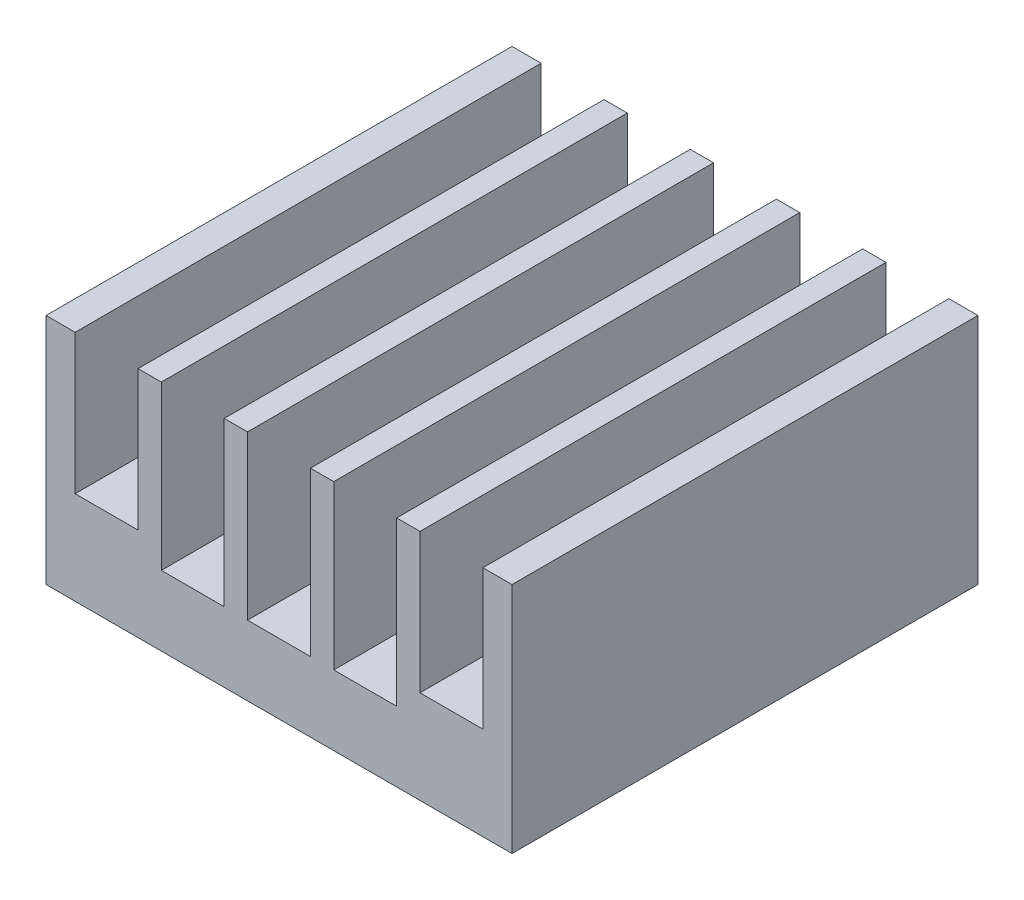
ISO-10303-21;
HEADER;
FILE_DESCRIPTION(('STEP AP214'),'2;1');
FILE_NAME('part.step','',(''),(''),'','','');
FILE_SCHEMA(('AUTOMOTIVE_DESIGN { 1 0 10303 214 1 1 1 1 }'));
ENDSEC;
DATA;
#1=APPLICATION_CONTEXT('core data for automotive mechanical design processes');
#2=APPLICATION_PROTOCOL_DEFINITION('international standard','automotive_design',2000,#1);
#3=PRODUCT_CONTEXT('',#1,'mechanical');
#4=PRODUCT('Part','Part','',(#3));
#5=PRODUCT_RELATED_PRODUCT_CATEGORY('part','',(#4));
#6=PRODUCT_DEFINITION_FORMATION('','',#4);
#7=PRODUCT_DEFINITION_CONTEXT('part definition',#1,'design');
#8=PRODUCT_DEFINITION('design','',#6,#7);
#9=PRODUCT_DEFINITION_SHAPE('','',#8);
#10=(LENGTH_UNIT() NAMED_UNIT(*) SI_UNIT(.MILLI.,.METRE.));
#11=(NAMED_UNIT(*) PLANE_ANGLE_UNIT() SI_UNIT($,.RADIAN.));
#12=(NAMED_UNIT(*) SI_UNIT($,.STERADIAN.) SOLID_ANGLE_UNIT());
#13=UNCERTAINTY_MEASURE_WITH_UNIT(LENGTH_MEASURE(1.E-05),#10,'distance_accuracy_value','');
#14=(GEOMETRIC_REPRESENTATION_CONTEXT(3) GLOBAL_UNCERTAINTY_ASSIGNED_CONTEXT((#13)) GLOBAL_UNIT_ASSIGNED_CONTEXT((#10,
#11,#12)) REPRESENTATION_CONTEXT('',''));
#15=CARTESIAN_POINT('',(0.,0.,0.));
#16=DIRECTION('',(0.,0.,1.));
#17=DIRECTION('',(1.,0.,0.));
#18=AXIS2_PLACEMENT_3D('',#15,#16,#17);
#19=CARTESIAN_POINT('',(-20.,20.,40.));
#20=DIRECTION('',(1.,0.,0.));
#21=DIRECTION('',(0.,0.,-1.));
#22=AXIS2_PLACEMENT_3D('',#19,#20,#21);
#23=PLANE('',#22);
#24=DIRECTION('',(0.,-1.,0.));
#25=VECTOR('',#24,1.);
#26=CARTESIAN_POINT('',(-20.,20.,0.));
#27=LINE('',#26,#25);
#28=CARTESIAN_POINT('',(-20.,20.,0.));
#29=VERTEX_POINT('',#28);
#30=CARTESIAN_POINT('',(-20.,0.,0.));
#31=VERTEX_POINT('',#30);
#32=EDGE_CURVE('E226',#29,#31,#27,.T.);
#33=ORIENTED_EDGE('',*,*,#32,.T.);
#34=DIRECTION('',(0.,0.,-1.));
#35=VECTOR('',#34,1.);
#36=CARTESIAN_POINT('',(-20.,0.,40.));
#37=LINE('',#36,#35);
#38=CARTESIAN_POINT('',(-20.,0.,40.));
#39=VERTEX_POINT('',#38);
#40=EDGE_CURVE('E11',#39,#31,#37,.T.);
#41=ORIENTED_EDGE('',*,*,#40,.F.);
#42=DIRECTION('',(0.,-1.,0.));
#43=VECTOR('',#42,1.);
#44=CARTESIAN_POINT('',(-20.,20.,40.));
#45=LINE('',#44,#43);
#46=CARTESIAN_POINT('',(-20.,20.,40.));
#47=VERTEX_POINT('',#46);
#48=EDGE_CURVE('E272',#47,#39,#45,.T.);
#49=ORIENTED_EDGE('',*,*,#48,.F.);
#50=DIRECTION('',(0.,0.,-1.));
#51=VECTOR('',#50,1.);
#52=CARTESIAN_POINT('',(-20.,20.,40.));
#53=LINE('',#52,#51);
#54=EDGE_CURVE('E222',#47,#29,#53,.T.);
#55=ORIENTED_EDGE('',*,*,#54,.T.);
#56=EDGE_LOOP('',(#33,#41,#49,#55));
#57=FACE_BOUND('',#56,.T.);
#58=ADVANCED_FACE('F34',(#57),#23,.F.);
#59=CARTESIAN_POINT('',(-20.,0.,40.));
#60=DIRECTION('',(0.,1.,0.));
#61=DIRECTION('',(0.,0.,1.));
#62=AXIS2_PLACEMENT_3D('',#59,#60,#61);
#63=PLANE('',#62);
#64=DIRECTION('',(1.,0.,0.));
#65=VECTOR('',#64,1.);
#66=CARTESIAN_POINT('',(-20.,0.,0.));
#67=LINE('',#66,#65);
#68=CARTESIAN_POINT('',(20.,0.,0.));
#69=VERTEX_POINT('',#68);
#70=EDGE_CURVE('E229',#31,#69,#67,.T.);
#71=ORIENTED_EDGE('',*,*,#70,.T.);
#72=DIRECTION('',(0.,0.,-1.));
#73=VECTOR('',#72,1.);
#74=CARTESIAN_POINT('',(20.,0.,40.));
#75=LINE('',#74,#73);
#76=CARTESIAN_POINT('',(20.,0.,40.));
#77=VERTEX_POINT('',#76);
#78=EDGE_CURVE('E42',#77,#69,#75,.T.);
#79=ORIENTED_EDGE('',*,*,#78,.F.);
#80=DIRECTION('',(1.,0.,0.));
#81=VECTOR('',#80,1.);
#82=CARTESIAN_POINT('',(-20.,0.,40.));
#83=LINE('',#82,#81);
#84=EDGE_CURVE('E141',#39,#77,#83,.T.);
#85=ORIENTED_EDGE('',*,*,#84,.F.);
#86=ORIENTED_EDGE('',*,*,#40,.T.);
#87=EDGE_LOOP('',(#71,#79,#85,#86));
#88=FACE_BOUND('',#87,.T.);
#89=ADVANCED_FACE('F410',(#88),#63,.F.);
#90=CARTESIAN_POINT('',(20.,0.,40.));
#91=DIRECTION('',(-1.,0.,0.));
#92=DIRECTION('',(0.,-1.,0.));
#93=AXIS2_PLACEMENT_3D('',#90,#91,#92);
#94=PLANE('',#93);
#95=DIRECTION('',(0.,1.,0.));
#96=VECTOR('',#95,1.);
#97=CARTESIAN_POINT('',(20.,0.,0.));
#98=LINE('',#97,#96);
#99=CARTESIAN_POINT('',(20.,20.,0.));
#100=VERTEX_POINT('',#99);
#101=EDGE_CURVE('E231',#69,#100,#98,.T.);
#102=ORIENTED_EDGE('',*,*,#101,.T.);
#103=DIRECTION('',(0.,0.,-1.));
#104=VECTOR('',#103,1.);
#105=CARTESIAN_POINT('',(20.,20.,40.));
#106=LINE('',#105,#104);
#107=CARTESIAN_POINT('',(20.,20.,40.));
#108=VERTEX_POINT('',#107);
#109=EDGE_CURVE('E327',#108,#100,#106,.T.);
#110=ORIENTED_EDGE('',*,*,#109,.F.);
#111=DIRECTION('',(0.,1.,0.));
#112=VECTOR('',#111,1.);
#113=CARTESIAN_POINT('',(20.,0.,40.));
#114=LINE('',#113,#112);
#115=EDGE_CURVE('E335',#77,#108,#114,.T.);
#116=ORIENTED_EDGE('',*,*,#115,.F.);
#117=ORIENTED_EDGE('',*,*,#78,.T.);
#118=EDGE_LOOP('',(#102,#110,#116,#117));
#119=FACE_BOUND('',#118,.T.);
#120=ADVANCED_FACE('F333',(#119),#94,.F.);
#121=CARTESIAN_POINT('',(20.,20.,40.));
#122=DIRECTION('',(0.,-1.,0.));
#123=DIRECTION('',(0.,0.,-1.));
#124=AXIS2_PLACEMENT_3D('',#121,#122,#123);
#125=PLANE('',#124);
#126=DIRECTION('',(-1.,0.,0.));
#127=VECTOR('',#126,1.);
#128=CARTESIAN_POINT('',(20.,20.,0.));
#129=LINE('',#128,#127);
#130=CARTESIAN_POINT('',(17.5,20.,0.));
#131=VERTEX_POINT('',#130);
#132=EDGE_CURVE('E233',#100,#131,#129,.T.);
#133=ORIENTED_EDGE('',*,*,#132,.T.);
#134=DIRECTION('',(0.,0.,-1.));
#135=VECTOR('',#134,1.);
#136=CARTESIAN_POINT('',(17.5,20.,40.));
#137=LINE('',#136,#135);
#138=CARTESIAN_POINT('',(17.5,20.,40.));
#139=VERTEX_POINT('',#138);
#140=EDGE_CURVE('E324',#139,#131,#137,.T.);
#141=ORIENTED_EDGE('',*,*,#140,.F.);
#142=DIRECTION('',(-1.,0.,0.));
#143=VECTOR('',#142,1.);
#144=CARTESIAN_POINT('',(20.,20.,40.));
#145=LINE('',#144,#143);
#146=EDGE_CURVE('E353',#108,#139,#145,.T.);
#147=ORIENTED_EDGE('',*,*,#146,.F.);
#148=ORIENTED_EDGE('',*,*,#109,.T.);
#149=EDGE_LOOP('',(#133,#141,#147,#148));
#150=FACE_BOUND('',#149,.T.);
#151=ADVANCED_FACE('F344',(#150),#125,.F.);
#152=CARTESIAN_POINT('',(17.5,20.,40.));
#153=DIRECTION('',(1.,0.,0.));
#154=DIRECTION('',(0.,0.,-1.));
#155=AXIS2_PLACEMENT_3D('',#152,#153,#154);
#156=PLANE('',#155);
#157=DIRECTION('',(0.,-1.,0.));
#158=VECTOR('',#157,1.);
#159=CARTESIAN_POINT('',(17.5,20.,0.));
#160=LINE('',#159,#158);
#161=CARTESIAN_POINT('',(17.5,8.,0.));
#162=VERTEX_POINT('',#161);
#163=EDGE_CURVE('E235',#131,#162,#160,.T.);
#164=ORIENTED_EDGE('',*,*,#163,.T.);
#165=DIRECTION('',(0.,0.,-1.));
#166=VECTOR('',#165,1.);
#167=CARTESIAN_POINT('',(17.5,8.,40.));
#168=LINE('',#167,#166);
#169=CARTESIAN_POINT('',(17.5,8.,40.));
#170=VERTEX_POINT('',#169);
#171=EDGE_CURVE('E321',#170,#162,#168,.T.);
#172=ORIENTED_EDGE('',*,*,#171,.F.);
#173=DIRECTION('',(0.,-1.,0.));
#174=VECTOR('',#173,1.);
#175=CARTESIAN_POINT('',(17.5,20.,40.));
#176=LINE('',#175,#174);
#177=EDGE_CURVE('E350',#139,#170,#176,.T.);
#178=ORIENTED_EDGE('',*,*,#177,.F.);
#179=ORIENTED_EDGE('',*,*,#140,.T.);
#180=EDGE_LOOP('',(#164,#172,#178,#179));
#181=FACE_BOUND('',#180,.T.);
#182=ADVANCED_FACE('F348',(#181),#156,.F.);
#183=CARTESIAN_POINT('',(17.5,8.,40.));
#184=DIRECTION('',(0.,-1.,0.));
#185=DIRECTION('',(0.,0.,-1.));
#186=AXIS2_PLACEMENT_3D('',#183,#184,#185);
#187=PLANE('',#186);
#188=DIRECTION('',(-1.,0.,0.));
#189=VECTOR('',#188,1.);
#190=CARTESIAN_POINT('',(17.5,8.,0.));
#191=LINE('',#190,#189);
#192=CARTESIAN_POINT('',(12.1,8.,0.));
#193=VERTEX_POINT('',#192);
#194=EDGE_CURVE('E237',#162,#193,#191,.T.);
#195=ORIENTED_EDGE('',*,*,#194,.T.);
#196=DIRECTION('',(0.,0.,-1.));
#197=VECTOR('',#196,1.);
#198=CARTESIAN_POINT('',(12.1,8.,40.));
#199=LINE('',#198,#197);
#200=CARTESIAN_POINT('',(12.1,8.,40.));
#201=VERTEX_POINT('',#200);
#202=EDGE_CURVE('E318',#201,#193,#199,.T.);
#203=ORIENTED_EDGE('',*,*,#202,.F.);
#204=DIRECTION('',(-1.,0.,0.));
#205=VECTOR('',#204,1.);
#206=CARTESIAN_POINT('',(17.5,8.,40.));
#207=LINE('',#206,#205);
#208=EDGE_CURVE('E352',#170,#201,#207,.T.);
#209=ORIENTED_EDGE('',*,*,#208,.F.);
#210=ORIENTED_EDGE('',*,*,#171,.T.);
#211=EDGE_LOOP('',(#195,#203,#209,#210));
#212=FACE_BOUND('',#211,.T.);
#213=ADVANCED_FACE('F423',(#212),#187,.F.);
#214=CARTESIAN_POINT('',(12.1,8.,40.));
#215=DIRECTION('',(-1.,0.,0.));
#216=DIRECTION('',(0.,0.,1.));
#217=AXIS2_PLACEMENT_3D('',#214,#215,#216);
#218=PLANE('',#217);
#219=DIRECTION('',(0.,1.,0.));
#220=VECTOR('',#219,1.);
#221=CARTESIAN_POINT('',(12.1,8.,0.));
#222=LINE('',#221,#220);
#223=CARTESIAN_POINT('',(12.1,20.,0.));
#224=VERTEX_POINT('',#223);
#225=EDGE_CURVE('E239',#193,#224,#222,.T.);
#226=ORIENTED_EDGE('',*,*,#225,.T.);
#227=DIRECTION('',(0.,0.,-1.));
#228=VECTOR('',#227,1.);
#229=CARTESIAN_POINT('',(12.1,20.,40.));
#230=LINE('',#229,#228);
#231=CARTESIAN_POINT('',(12.1,20.,40.));
#232=VERTEX_POINT('',#231);
#233=EDGE_CURVE('E315',#232,#224,#230,.T.);
#234=ORIENTED_EDGE('',*,*,#233,.F.);
#235=DIRECTION('',(0.,1.,0.));
#236=VECTOR('',#235,1.);
#237=CARTESIAN_POINT('',(12.1,8.,40.));
#238=LINE('',#237,#236);
#239=EDGE_CURVE('E355',#201,#232,#238,.T.);
#240=ORIENTED_EDGE('',*,*,#239,.F.);
#241=ORIENTED_EDGE('',*,*,#202,.T.);
#242=EDGE_LOOP('',(#226,#234,#240,#241));
#243=FACE_BOUND('',#242,.T.);
#244=ADVANCED_FACE('F426',(#243),#218,.F.);
#245=CARTESIAN_POINT('',(12.1,20.,40.));
#246=DIRECTION('',(0.,-1.,0.));
#247=DIRECTION('',(1.,0.,0.));
#248=AXIS2_PLACEMENT_3D('',#245,#246,#247);
#249=PLANE('',#248);
#250=DIRECTION('',(-1.,0.,0.));
#251=VECTOR('',#250,1.);
#252=CARTESIAN_POINT('',(12.1,20.,0.));
#253=LINE('',#252,#251);
#254=CARTESIAN_POINT('',(10.1,20.,0.));
#255=VERTEX_POINT('',#254);
#256=EDGE_CURVE('E241',#224,#255,#253,.T.);
#257=ORIENTED_EDGE('',*,*,#256,.T.);
#258=DIRECTION('',(0.,0.,-1.));
#259=VECTOR('',#258,1.);
#260=CARTESIAN_POINT('',(10.1,20.,40.));
#261=LINE('',#260,#259);
#262=CARTESIAN_POINT('',(10.1,20.,40.));
#263=VERTEX_POINT('',#262);
#264=EDGE_CURVE('E312',#263,#255,#261,.T.);
#265=ORIENTED_EDGE('',*,*,#264,.F.);
#266=DIRECTION('',(-1.,0.,0.));
#267=VECTOR('',#266,1.);
#268=CARTESIAN_POINT('',(12.1,20.,40.));
#269=LINE('',#268,#267);
#270=EDGE_CURVE('E361',#232,#263,#269,.T.);
#271=ORIENTED_EDGE('',*,*,#270,.F.);
#272=ORIENTED_EDGE('',*,*,#233,.T.);
#273=EDGE_LOOP('',(#257,#265,#271,#272));
#274=FACE_BOUND('',#273,.T.);
#275=ADVANCED_FACE('F430',(#274),#249,.F.);
#276=CARTESIAN_POINT('',(10.1,20.,40.));
#277=DIRECTION('',(1.,0.,0.));
#278=DIRECTION('',(0.,1.,0.));
#279=AXIS2_PLACEMENT_3D('',#276,#277,#278);
#280=PLANE('',#279);
#281=DIRECTION('',(0.,-1.,0.));
#282=VECTOR('',#281,1.);
#283=CARTESIAN_POINT('',(10.1,20.,0.));
#284=LINE('',#283,#282);
#285=CARTESIAN_POINT('',(10.1,6.,0.));
#286=VERTEX_POINT('',#285);
#287=EDGE_CURVE('E243',#255,#286,#284,.T.);
#288=ORIENTED_EDGE('',*,*,#287,.T.);
#289=DIRECTION('',(0.,0.,-1.));
#290=VECTOR('',#289,1.);
#291=CARTESIAN_POINT('',(10.1,6.,40.));
#292=LINE('',#291,#290);
#293=CARTESIAN_POINT('',(10.1,6.,40.));
#294=VERTEX_POINT('',#293);
#295=EDGE_CURVE('E309',#294,#286,#292,.T.);
#296=ORIENTED_EDGE('',*,*,#295,.F.);
#297=DIRECTION('',(0.,-1.,0.));
#298=VECTOR('',#297,1.);
#299=CARTESIAN_POINT('',(10.1,20.,40.));
#300=LINE('',#299,#298);
#301=EDGE_CURVE('E363',#263,#294,#300,.T.);
#302=ORIENTED_EDGE('',*,*,#301,.F.);
#303=ORIENTED_EDGE('',*,*,#264,.T.);
#304=EDGE_LOOP('',(#288,#296,#302,#303));
#305=FACE_BOUND('',#304,.T.);
#306=ADVANCED_FACE('F434',(#305),#280,.F.);
#307=CARTESIAN_POINT('',(10.1,6.,40.));
#308=DIRECTION('',(0.,-1.,0.));
#309=DIRECTION('',(0.,0.,-1.));
#310=AXIS2_PLACEMENT_3D('',#307,#308,#309);
#311=PLANE('',#310);
#312=DIRECTION('',(-1.,0.,0.));
#313=VECTOR('',#312,1.);
#314=CARTESIAN_POINT('',(10.1,6.,0.));
#315=LINE('',#314,#313);
#316=CARTESIAN_POINT('',(4.7,6.,0.));
#317=VERTEX_POINT('',#316);
#318=EDGE_CURVE('E245',#286,#317,#315,.T.);
#319=ORIENTED_EDGE('',*,*,#318,.T.);
#320=DIRECTION('',(0.,0.,-1.));
#321=VECTOR('',#320,1.);
#322=CARTESIAN_POINT('',(4.7,6.,40.));
#323=LINE('',#322,#321);
#324=CARTESIAN_POINT('',(4.7,6.,40.));
#325=VERTEX_POINT('',#324);
#326=EDGE_CURVE('E306',#325,#317,#323,.T.);
#327=ORIENTED_EDGE('',*,*,#326,.F.);
#328=DIRECTION('',(-1.,0.,0.));
#329=VECTOR('',#328,1.);
#330=CARTESIAN_POINT('',(10.1,6.,40.));
#331=LINE('',#330,#329);
#332=EDGE_CURVE('E365',#294,#325,#331,.T.);
#333=ORIENTED_EDGE('',*,*,#332,.F.);
#334=ORIENTED_EDGE('',*,*,#295,.T.);
#335=EDGE_LOOP('',(#319,#327,#333,#334));
#336=FACE_BOUND('',#335,.T.);
#337=ADVANCED_FACE('F438',(#336),#311,.F.);
#338=CARTESIAN_POINT('',(4.7,6.,40.));
#339=DIRECTION('',(-1.,0.,0.));
#340=DIRECTION('',(0.,0.,1.));
#341=AXIS2_PLACEMENT_3D('',#338,#339,#340);
#342=PLANE('',#341);
#343=DIRECTION('',(0.,1.,0.));
#344=VECTOR('',#343,1.);
#345=CARTESIAN_POINT('',(4.7,6.,0.));
#346=LINE('',#345,#344);
#347=CARTESIAN_POINT('',(4.7,20.,0.));
#348=VERTEX_POINT('',#347);
#349=EDGE_CURVE('E247',#317,#348,#346,.T.);
#350=ORIENTED_EDGE('',*,*,#349,.T.);
#351=DIRECTION('',(0.,0.,-1.));
#352=VECTOR('',#351,1.);
#353=CARTESIAN_POINT('',(4.7,20.,40.));
#354=LINE('',#353,#352);
#355=CARTESIAN_POINT('',(4.7,20.,40.));
#356=VERTEX_POINT('',#355);
#357=EDGE_CURVE('E303',#356,#348,#354,.T.);
#358=ORIENTED_EDGE('',*,*,#357,.F.);
#359=DIRECTION('',(0.,1.,0.));
#360=VECTOR('',#359,1.);
#361=CARTESIAN_POINT('',(4.7,6.,40.));
#362=LINE('',#361,#360);
#363=EDGE_CURVE('E367',#325,#356,#362,.T.);
#364=ORIENTED_EDGE('',*,*,#363,.F.);
#365=ORIENTED_EDGE('',*,*,#326,.T.);
#366=EDGE_LOOP('',(#350,#358,#364,#365));
#367=FACE_BOUND('',#366,.T.);
#368=ADVANCED_FACE('F442',(#367),#342,.F.);
#369=CARTESIAN_POINT('',(4.7,20.,40.));
#370=DIRECTION('',(0.,-1.,0.));
#371=DIRECTION('',(0.,0.,-1.));
#372=AXIS2_PLACEMENT_3D('',#369,#370,#371);
#373=PLANE('',#372);
#374=DIRECTION('',(-1.,0.,0.));
#375=VECTOR('',#374,1.);
#376=CARTESIAN_POINT('',(4.7,20.,0.));
#377=LINE('',#376,#375);
#378=CARTESIAN_POINT('',(2.7,20.,0.));
#379=VERTEX_POINT('',#378);
#380=EDGE_CURVE('E249',#348,#379,#377,.T.);
#381=ORIENTED_EDGE('',*,*,#380,.T.);
#382=DIRECTION('',(0.,0.,-1.));
#383=VECTOR('',#382,1.);
#384=CARTESIAN_POINT('',(2.7,20.,40.));
#385=LINE('',#384,#383);
#386=CARTESIAN_POINT('',(2.7,20.,40.));
#387=VERTEX_POINT('',#386);
#388=EDGE_CURVE('E300',#387,#379,#385,.T.);
#389=ORIENTED_EDGE('',*,*,#388,.F.);
#390=DIRECTION('',(-1.,0.,0.));
#391=VECTOR('',#390,1.);
#392=CARTESIAN_POINT('',(4.7,20.,40.));
#393=LINE('',#392,#391);
#394=EDGE_CURVE('E369',#356,#387,#393,.T.);
#395=ORIENTED_EDGE('',*,*,#394,.F.);
#396=ORIENTED_EDGE('',*,*,#357,.T.);
#397=EDGE_LOOP('',(#381,#389,#395,#396));
#398=FACE_BOUND('',#397,.T.);
#399=ADVANCED_FACE('F446',(#398),#373,.F.);
#400=CARTESIAN_POINT('',(2.7,20.,40.));
#401=DIRECTION('',(1.,0.,0.));
#402=DIRECTION('',(0.,0.,-1.));
#403=AXIS2_PLACEMENT_3D('',#400,#401,#402);
#404=PLANE('',#403);
#405=DIRECTION('',(0.,-1.,0.));
#406=VECTOR('',#405,1.);
#407=CARTESIAN_POINT('',(2.7,20.,0.));
#408=LINE('',#407,#406);
#409=CARTESIAN_POINT('',(2.7,6.,0.));
#410=VERTEX_POINT('',#409);
#411=EDGE_CURVE('E251',#379,#410,#408,.T.);
#412=ORIENTED_EDGE('',*,*,#411,.T.);
#413=DIRECTION('',(0.,0.,-1.));
#414=VECTOR('',#413,1.);
#415=CARTESIAN_POINT('',(2.7,6.,40.));
#416=LINE('',#415,#414);
#417=CARTESIAN_POINT('',(2.7,6.,40.));
#418=VERTEX_POINT('',#417);
#419=EDGE_CURVE('E297',#418,#410,#416,.T.);
#420=ORIENTED_EDGE('',*,*,#419,.F.);
#421=DIRECTION('',(0.,-1.,0.));
#422=VECTOR('',#421,1.);
#423=CARTESIAN_POINT('',(2.7,20.,40.));
#424=LINE('',#423,#422);
#425=EDGE_CURVE('E371',#387,#418,#424,.T.);
#426=ORIENTED_EDGE('',*,*,#425,.F.);
#427=ORIENTED_EDGE('',*,*,#388,.T.);
#428=EDGE_LOOP('',(#412,#420,#426,#427));
#429=FACE_BOUND('',#428,.T.);
#430=ADVANCED_FACE('F450',(#429),#404,.F.);
#431=CARTESIAN_POINT('',(2.7,6.,40.));
#432=DIRECTION('',(0.,-1.,0.));
#433=DIRECTION('',(0.,0.,-1.));
#434=AXIS2_PLACEMENT_3D('',#431,#432,#433);
#435=PLANE('',#434);
#436=DIRECTION('',(-1.,0.,0.));
#437=VECTOR('',#436,1.);
#438=CARTESIAN_POINT('',(2.7,6.,0.));
#439=LINE('',#438,#437);
#440=CARTESIAN_POINT('',(-2.69999999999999,6.,0.));
#441=VERTEX_POINT('',#440);
#442=EDGE_CURVE('E253',#410,#441,#439,.T.);
#443=ORIENTED_EDGE('',*,*,#442,.T.);
#444=DIRECTION('',(0.,0.,-1.));
#445=VECTOR('',#444,1.);
#446=CARTESIAN_POINT('',(-2.69999999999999,6.,40.));
#447=LINE('',#446,#445);
#448=CARTESIAN_POINT('',(-2.69999999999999,6.,40.));
#449=VERTEX_POINT('',#448);
#450=EDGE_CURVE('E294',#449,#441,#447,.T.);
#451=ORIENTED_EDGE('',*,*,#450,.F.);
#452=DIRECTION('',(-1.,0.,0.));
#453=VECTOR('',#452,1.);
#454=CARTESIAN_POINT('',(2.7,6.,40.));
#455=LINE('',#454,#453);
#456=EDGE_CURVE('E373',#418,#449,#455,.T.);
#457=ORIENTED_EDGE('',*,*,#456,.F.);
#458=ORIENTED_EDGE('',*,*,#419,.T.);
#459=EDGE_LOOP('',(#443,#451,#457,#458));
#460=FACE_BOUND('',#459,.T.);
#461=ADVANCED_FACE('F454',(#460),#435,.F.);
#462=CARTESIAN_POINT('',(-2.69999999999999,6.,40.));
#463=DIRECTION('',(-1.,0.,0.));
#464=DIRECTION('',(0.,-1.,0.));
#465=AXIS2_PLACEMENT_3D('',#462,#463,#464);
#466=PLANE('',#465);
#467=DIRECTION('',(0.,1.,0.));
#468=VECTOR('',#467,1.);
#469=CARTESIAN_POINT('',(-2.69999999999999,6.,0.));
#470=LINE('',#469,#468);
#471=CARTESIAN_POINT('',(-2.7,20.,0.));
#472=VERTEX_POINT('',#471);
#473=EDGE_CURVE('E255',#441,#472,#470,.T.);
#474=ORIENTED_EDGE('',*,*,#473,.T.);
#475=DIRECTION('',(0.,0.,-1.));
#476=VECTOR('',#475,1.);
#477=CARTESIAN_POINT('',(-2.7,20.,40.));
#478=LINE('',#477,#476);
#479=CARTESIAN_POINT('',(-2.7,20.,40.));
#480=VERTEX_POINT('',#479);
#481=EDGE_CURVE('E291',#480,#472,#478,.T.);
#482=ORIENTED_EDGE('',*,*,#481,.F.);
#483=DIRECTION('',(0.,1.,0.));
#484=VECTOR('',#483,1.);
#485=CARTESIAN_POINT('',(-2.69999999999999,6.,40.));
#486=LINE('',#485,#484);
#487=EDGE_CURVE('E375',#449,#480,#486,.T.);
#488=ORIENTED_EDGE('',*,*,#487,.F.);
#489=ORIENTED_EDGE('',*,*,#450,.T.);
#490=EDGE_LOOP('',(#474,#482,#488,#489));
#491=FACE_BOUND('',#490,.T.);
#492=ADVANCED_FACE('F458',(#491),#466,.F.);
#493=CARTESIAN_POINT('',(-2.7,20.,40.));
#494=DIRECTION('',(0.,-1.,0.));
#495=DIRECTION('',(0.,0.,-1.));
#496=AXIS2_PLACEMENT_3D('',#493,#494,#495);
#497=PLANE('',#496);
#498=DIRECTION('',(-1.,0.,0.));
#499=VECTOR('',#498,1.);
#500=CARTESIAN_POINT('',(-2.7,20.,0.));
#501=LINE('',#500,#499);
#502=CARTESIAN_POINT('',(-4.7,20.,0.));
#503=VERTEX_POINT('',#502);
#504=EDGE_CURVE('E257',#472,#503,#501,.T.);
#505=ORIENTED_EDGE('',*,*,#504,.T.);
#506=DIRECTION('',(0.,0.,-1.));
#507=VECTOR('',#506,1.);
#508=CARTESIAN_POINT('',(-4.7,20.,40.));
#509=LINE('',#508,#507);
#510=CARTESIAN_POINT('',(-4.7,20.,40.));
#511=VERTEX_POINT('',#510);
#512=EDGE_CURVE('E288',#511,#503,#509,.T.);
#513=ORIENTED_EDGE('',*,*,#512,.F.);
#514=DIRECTION('',(-1.,0.,0.));
#515=VECTOR('',#514,1.);
#516=CARTESIAN_POINT('',(-2.7,20.,40.));
#517=LINE('',#516,#515);
#518=EDGE_CURVE('E377',#480,#511,#517,.T.);
#519=ORIENTED_EDGE('',*,*,#518,.F.);
#520=ORIENTED_EDGE('',*,*,#481,.T.);
#521=EDGE_LOOP('',(#505,#513,#519,#520));
#522=FACE_BOUND('',#521,.T.);
#523=ADVANCED_FACE('F462',(#522),#497,.F.);
#524=CARTESIAN_POINT('',(-4.7,20.,40.));
#525=DIRECTION('',(1.,0.,0.));
#526=DIRECTION('',(0.,1.,0.));
#527=AXIS2_PLACEMENT_3D('',#524,#525,#526);
#528=PLANE('',#527);
#529=DIRECTION('',(0.,-1.,0.));
#530=VECTOR('',#529,1.);
#531=CARTESIAN_POINT('',(-4.7,20.,0.));
#532=LINE('',#531,#530);
#533=CARTESIAN_POINT('',(-4.7,6.,0.));
#534=VERTEX_POINT('',#533);
#535=EDGE_CURVE('E259',#503,#534,#532,.T.);
#536=ORIENTED_EDGE('',*,*,#535,.T.);
#537=DIRECTION('',(0.,0.,-1.));
#538=VECTOR('',#537,1.);
#539=CARTESIAN_POINT('',(-4.7,6.,40.));
#540=LINE('',#539,#538);
#541=CARTESIAN_POINT('',(-4.7,6.,40.));
#542=VERTEX_POINT('',#541);
#543=EDGE_CURVE('E285',#542,#534,#540,.T.);
#544=ORIENTED_EDGE('',*,*,#543,.F.);
#545=DIRECTION('',(0.,-1.,0.));
#546=VECTOR('',#545,1.);
#547=CARTESIAN_POINT('',(-4.7,20.,40.));
#548=LINE('',#547,#546);
#549=EDGE_CURVE('E379',#511,#542,#548,.T.);
#550=ORIENTED_EDGE('',*,*,#549,.F.);
#551=ORIENTED_EDGE('',*,*,#512,.T.);
#552=EDGE_LOOP('',(#536,#544,#550,#551));
#553=FACE_BOUND('',#552,.T.);
#554=ADVANCED_FACE('F466',(#553),#528,.F.);
#555=CARTESIAN_POINT('',(-4.7,6.,40.));
#556=DIRECTION('',(0.,-1.,0.));
#557=DIRECTION('',(0.,0.,-1.));
#558=AXIS2_PLACEMENT_3D('',#555,#556,#557);
#559=PLANE('',#558);
#560=DIRECTION('',(-1.,0.,0.));
#561=VECTOR('',#560,1.);
#562=CARTESIAN_POINT('',(-4.7,6.,0.));
#563=LINE('',#562,#561);
#564=CARTESIAN_POINT('',(-10.1,6.,0.));
#565=VERTEX_POINT('',#564);
#566=EDGE_CURVE('E261',#534,#565,#563,.T.);
#567=ORIENTED_EDGE('',*,*,#566,.T.);
#568=DIRECTION('',(0.,0.,-1.));
#569=VECTOR('',#568,1.);
#570=CARTESIAN_POINT('',(-10.1,6.,40.));
#571=LINE('',#570,#569);
#572=CARTESIAN_POINT('',(-10.1,6.,40.));
#573=VERTEX_POINT('',#572);
#574=EDGE_CURVE('E282',#573,#565,#571,.T.);
#575=ORIENTED_EDGE('',*,*,#574,.F.);
#576=DIRECTION('',(-1.,0.,0.));
#577=VECTOR('',#576,1.);
#578=CARTESIAN_POINT('',(-4.7,6.,40.));
#579=LINE('',#578,#577);
#580=EDGE_CURVE('E381',#542,#573,#579,.T.);
#581=ORIENTED_EDGE('',*,*,#580,.F.);
#582=ORIENTED_EDGE('',*,*,#543,.T.);
#583=EDGE_LOOP('',(#567,#575,#581,#582));
#584=FACE_BOUND('',#583,.T.);
#585=ADVANCED_FACE('F470',(#584),#559,.F.);
#586=CARTESIAN_POINT('',(-10.1,6.,40.));
#587=DIRECTION('',(-1.,0.,0.));
#588=DIRECTION('',(0.,-1.,0.));
#589=AXIS2_PLACEMENT_3D('',#586,#587,#588);
#590=PLANE('',#589);
#591=DIRECTION('',(0.,1.,0.));
#592=VECTOR('',#591,1.);
#593=CARTESIAN_POINT('',(-10.1,6.,0.));
#594=LINE('',#593,#592);
#595=CARTESIAN_POINT('',(-10.1,20.,0.));
#596=VERTEX_POINT('',#595);
#597=EDGE_CURVE('E263',#565,#596,#594,.T.);
#598=ORIENTED_EDGE('',*,*,#597,.T.);
#599=DIRECTION('',(0.,0.,-1.));
#600=VECTOR('',#599,1.);
#601=CARTESIAN_POINT('',(-10.1,20.,40.));
#602=LINE('',#601,#600);
#603=CARTESIAN_POINT('',(-10.1,20.,40.));
#604=VERTEX_POINT('',#603);
#605=EDGE_CURVE('E279',#604,#596,#602,.T.);
#606=ORIENTED_EDGE('',*,*,#605,.F.);
#607=DIRECTION('',(0.,1.,0.));
#608=VECTOR('',#607,1.);
#609=CARTESIAN_POINT('',(-10.1,6.,40.));
#610=LINE('',#609,#608);
#611=EDGE_CURVE('E383',#573,#604,#610,.T.);
#612=ORIENTED_EDGE('',*,*,#611,.F.);
#613=ORIENTED_EDGE('',*,*,#574,.T.);
#614=EDGE_LOOP('',(#598,#606,#612,#613));
#615=FACE_BOUND('',#614,.T.);
#616=ADVANCED_FACE('F474',(#615),#590,.F.);
#617=CARTESIAN_POINT('',(-10.1,20.,40.));
#618=DIRECTION('',(0.,-1.,0.));
#619=DIRECTION('',(1.,0.,0.));
#620=AXIS2_PLACEMENT_3D('',#617,#618,#619);
#621=PLANE('',#620);
#622=DIRECTION('',(-1.,0.,0.));
#623=VECTOR('',#622,1.);
#624=CARTESIAN_POINT('',(-10.1,20.,0.));
#625=LINE('',#624,#623);
#626=CARTESIAN_POINT('',(-12.1,20.,0.));
#627=VERTEX_POINT('',#626);
#628=EDGE_CURVE('E265',#596,#627,#625,.T.);
#629=ORIENTED_EDGE('',*,*,#628,.T.);
#630=DIRECTION('',(0.,0.,-1.));
#631=VECTOR('',#630,1.);
#632=CARTESIAN_POINT('',(-12.1,20.,40.));
#633=LINE('',#632,#631);
#634=CARTESIAN_POINT('',(-12.1,20.,40.));
#635=VERTEX_POINT('',#634);
#636=EDGE_CURVE('E276',#635,#627,#633,.T.);
#637=ORIENTED_EDGE('',*,*,#636,.F.);
#638=DIRECTION('',(-1.,0.,0.));
#639=VECTOR('',#638,1.);
#640=CARTESIAN_POINT('',(-10.1,20.,40.));
#641=LINE('',#640,#639);
#642=EDGE_CURVE('E385',#604,#635,#641,.T.);
#643=ORIENTED_EDGE('',*,*,#642,.F.);
#644=ORIENTED_EDGE('',*,*,#605,.T.);
#645=EDGE_LOOP('',(#629,#637,#643,#644));
#646=FACE_BOUND('',#645,.T.);
#647=ADVANCED_FACE('F391',(#646),#621,.F.);
#648=CARTESIAN_POINT('',(-12.1,20.,40.));
#649=DIRECTION('',(1.,0.,0.));
#650=DIRECTION('',(0.,0.,-1.));
#651=AXIS2_PLACEMENT_3D('',#648,#649,#650);
#652=PLANE('',#651);
#653=DIRECTION('',(0.,-1.,0.));
#654=VECTOR('',#653,1.);
#655=CARTESIAN_POINT('',(-12.1,20.,0.));
#656=LINE('',#655,#654);
#657=CARTESIAN_POINT('',(-12.1,8.,0.));
#658=VERTEX_POINT('',#657);
#659=EDGE_CURVE('E267',#627,#658,#656,.T.);
#660=ORIENTED_EDGE('',*,*,#659,.T.);
#661=DIRECTION('',(0.,0.,-1.));
#662=VECTOR('',#661,1.);
#663=CARTESIAN_POINT('',(-12.1,8.,40.));
#664=LINE('',#663,#662);
#665=CARTESIAN_POINT('',(-12.1,8.,40.));
#666=VERTEX_POINT('',#665);
#667=EDGE_CURVE('E217',#666,#658,#664,.T.);
#668=ORIENTED_EDGE('',*,*,#667,.F.);
#669=DIRECTION('',(0.,-1.,0.));
#670=VECTOR('',#669,1.);
#671=CARTESIAN_POINT('',(-12.1,20.,40.));
#672=LINE('',#671,#670);
#673=EDGE_CURVE('E208',#635,#666,#672,.T.);
#674=ORIENTED_EDGE('',*,*,#673,.F.);
#675=ORIENTED_EDGE('',*,*,#636,.T.);
#676=EDGE_LOOP('',(#660,#668,#674,#675));
#677=FACE_BOUND('',#676,.T.);
#678=ADVANCED_FACE('F395',(#677),#652,.F.);
#679=CARTESIAN_POINT('',(-12.1,8.,40.));
#680=DIRECTION('',(0.,-1.,0.));
#681=DIRECTION('',(0.,0.,-1.));
#682=AXIS2_PLACEMENT_3D('',#679,#680,#681);
#683=PLANE('',#682);
#684=DIRECTION('',(-1.,0.,0.));
#685=VECTOR('',#684,1.);
#686=CARTESIAN_POINT('',(-12.1,8.,0.));
#687=LINE('',#686,#685);
#688=CARTESIAN_POINT('',(-17.5,8.,0.));
#689=VERTEX_POINT('',#688);
#690=EDGE_CURVE('E216',#658,#689,#687,.T.);
#691=ORIENTED_EDGE('',*,*,#690,.T.);
#692=DIRECTION('',(0.,0.,-1.));
#693=VECTOR('',#692,1.);
#694=CARTESIAN_POINT('',(-17.5,8.,40.));
#695=LINE('',#694,#693);
#696=CARTESIAN_POINT('',(-17.5,8.,40.));
#697=VERTEX_POINT('',#696);
#698=EDGE_CURVE('E213',#697,#689,#695,.T.);
#699=ORIENTED_EDGE('',*,*,#698,.F.);
#700=DIRECTION('',(-1.,0.,0.));
#701=VECTOR('',#700,1.);
#702=CARTESIAN_POINT('',(-12.1,8.,40.));
#703=LINE('',#702,#701);
#704=EDGE_CURVE('E202',#666,#697,#703,.T.);
#705=ORIENTED_EDGE('',*,*,#704,.F.);
#706=ORIENTED_EDGE('',*,*,#667,.T.);
#707=EDGE_LOOP('',(#691,#699,#705,#706));
#708=FACE_BOUND('',#707,.T.);
#709=ADVANCED_FACE('F214',(#708),#683,.F.);
#710=CARTESIAN_POINT('',(-17.5,8.,40.));
#711=DIRECTION('',(-1.,0.,0.));
#712=DIRECTION('',(0.,0.,1.));
#713=AXIS2_PLACEMENT_3D('',#710,#711,#712);
#714=PLANE('',#713);
#715=DIRECTION('',(0.,1.,0.));
#716=VECTOR('',#715,1.);
#717=CARTESIAN_POINT('',(-17.5,8.,0.));
#718=LINE('',#717,#716);
#719=CARTESIAN_POINT('',(-17.5,20.,0.));
#720=VERTEX_POINT('',#719);
#721=EDGE_CURVE('E127',#689,#720,#718,.T.);
#722=ORIENTED_EDGE('',*,*,#721,.T.);
#723=DIRECTION('',(0.,0.,-1.));
#724=VECTOR('',#723,1.);
#725=CARTESIAN_POINT('',(-17.5,20.,40.));
#726=LINE('',#725,#724);
#727=CARTESIAN_POINT('',(-17.5,20.,40.));
#728=VERTEX_POINT('',#727);
#729=EDGE_CURVE('E218',#728,#720,#726,.T.);
#730=ORIENTED_EDGE('',*,*,#729,.F.);
#731=DIRECTION('',(0.,1.,0.));
#732=VECTOR('',#731,1.);
#733=CARTESIAN_POINT('',(-17.5,8.,40.));
#734=LINE('',#733,#732);
#735=EDGE_CURVE('E206',#697,#728,#734,.T.);
#736=ORIENTED_EDGE('',*,*,#735,.F.);
#737=ORIENTED_EDGE('',*,*,#698,.T.);
#738=EDGE_LOOP('',(#722,#730,#736,#737));
#739=FACE_BOUND('',#738,.T.);
#740=ADVANCED_FACE('F220',(#739),#714,.F.);
#741=CARTESIAN_POINT('',(-17.5,20.,40.));
#742=DIRECTION('',(0.,-1.,0.));
#743=DIRECTION('',(0.,0.,-1.));
#744=AXIS2_PLACEMENT_3D('',#741,#742,#743);
#745=PLANE('',#744);
#746=DIRECTION('',(-1.,0.,0.));
#747=VECTOR('',#746,1.);
#748=CARTESIAN_POINT('',(-17.5,20.,0.));
#749=LINE('',#748,#747);
#750=EDGE_CURVE('E133',#720,#29,#749,.T.);
#751=ORIENTED_EDGE('',*,*,#750,.T.);
#752=ORIENTED_EDGE('',*,*,#54,.F.);
#753=DIRECTION('',(-1.,0.,0.));
#754=VECTOR('',#753,1.);
#755=CARTESIAN_POINT('',(-17.5,20.,40.));
#756=LINE('',#755,#754);
#757=EDGE_CURVE('E50',#728,#47,#756,.T.);
#758=ORIENTED_EDGE('',*,*,#757,.F.);
#759=ORIENTED_EDGE('',*,*,#729,.T.);
#760=EDGE_LOOP('',(#751,#752,#758,#759));
#761=FACE_BOUND('',#760,.T.);
#762=ADVANCED_FACE('F399',(#761),#745,.F.);
#763=CARTESIAN_POINT('',(-20.,0.,40.));
#764=DIRECTION('',(0.,0.,1.));
#765=DIRECTION('',(1.,0.,0.));
#766=AXIS2_PLACEMENT_3D('',#763,#764,#765);
#767=PLANE('',#766);
#768=ORIENTED_EDGE('',*,*,#48,.T.);
#769=ORIENTED_EDGE('',*,*,#84,.T.);
#770=ORIENTED_EDGE('',*,*,#115,.T.);
#771=ORIENTED_EDGE('',*,*,#146,.T.);
#772=ORIENTED_EDGE('',*,*,#177,.T.);
#773=ORIENTED_EDGE('',*,*,#208,.T.);
#774=ORIENTED_EDGE('',*,*,#239,.T.);
#775=ORIENTED_EDGE('',*,*,#270,.T.);
#776=ORIENTED_EDGE('',*,*,#301,.T.);
#777=ORIENTED_EDGE('',*,*,#332,.T.);
#778=ORIENTED_EDGE('',*,*,#363,.T.);
#779=ORIENTED_EDGE('',*,*,#394,.T.);
#780=ORIENTED_EDGE('',*,*,#425,.T.);
#781=ORIENTED_EDGE('',*,*,#456,.T.);
#782=ORIENTED_EDGE('',*,*,#487,.T.);
#783=ORIENTED_EDGE('',*,*,#518,.T.);
#784=ORIENTED_EDGE('',*,*,#549,.T.);
#785=ORIENTED_EDGE('',*,*,#580,.T.);
#786=ORIENTED_EDGE('',*,*,#611,.T.);
#787=ORIENTED_EDGE('',*,*,#642,.T.);
#788=ORIENTED_EDGE('',*,*,#673,.T.);
#789=ORIENTED_EDGE('',*,*,#704,.T.);
#790=ORIENTED_EDGE('',*,*,#735,.T.);
#791=ORIENTED_EDGE('',*,*,#757,.T.);
#792=EDGE_LOOP('',(#768,#769,#770,#771,#772,#773,#774,#775,#776,#777,#778,#779,#780,#781,#782,
#783,#784,#785,#786,#787,#788,#789,#790,#791));
#793=FACE_BOUND('',#792,.T.);
#794=ADVANCED_FACE('F204',(#793),#767,.T.);
#795=CARTESIAN_POINT('',(-20.,0.,0.));
#796=DIRECTION('',(0.,0.,1.));
#797=DIRECTION('',(1.,0.,0.));
#798=AXIS2_PLACEMENT_3D('',#795,#796,#797);
#799=PLANE('',#798);
#800=ORIENTED_EDGE('',*,*,#32,.F.);
#801=ORIENTED_EDGE('',*,*,#750,.F.);
#802=ORIENTED_EDGE('',*,*,#721,.F.);
#803=ORIENTED_EDGE('',*,*,#690,.F.);
#804=ORIENTED_EDGE('',*,*,#659,.F.);
#805=ORIENTED_EDGE('',*,*,#628,.F.);
#806=ORIENTED_EDGE('',*,*,#597,.F.);
#807=ORIENTED_EDGE('',*,*,#566,.F.);
#808=ORIENTED_EDGE('',*,*,#535,.F.);
#809=ORIENTED_EDGE('',*,*,#504,.F.);
#810=ORIENTED_EDGE('',*,*,#473,.F.);
#811=ORIENTED_EDGE('',*,*,#442,.F.);
#812=ORIENTED_EDGE('',*,*,#411,.F.);
#813=ORIENTED_EDGE('',*,*,#380,.F.);
#814=ORIENTED_EDGE('',*,*,#349,.F.);
#815=ORIENTED_EDGE('',*,*,#318,.F.);
#816=ORIENTED_EDGE('',*,*,#287,.F.);
#817=ORIENTED_EDGE('',*,*,#256,.F.);
#818=ORIENTED_EDGE('',*,*,#225,.F.);
#819=ORIENTED_EDGE('',*,*,#194,.F.);
#820=ORIENTED_EDGE('',*,*,#163,.F.);
#821=ORIENTED_EDGE('',*,*,#132,.F.);
#822=ORIENTED_EDGE('',*,*,#101,.F.);
#823=ORIENTED_EDGE('',*,*,#70,.F.);
#824=EDGE_LOOP('',(#800,#801,#802,#803,#804,#805,#806,#807,#808,#809,#810,#811,#812,#813,#814,
#815,#816,#817,#818,#819,#820,#821,#822,#823));
#825=FACE_BOUND('',#824,.T.);
#826=ADVANCED_FACE('F339',(#825),#799,.F.);
#827=CLOSED_SHELL('',(#58,#89,#120,#151,#182,#213,#244,#275,#306,#337,#368,#399,#430,#461,#492,
#523,#554,#585,#616,#647,#678,#709,#740,#762,#794,#826));
#828=MANIFOLD_SOLID_BREP('B2',#827);
#829=ADVANCED_BREP_SHAPE_REPRESENTATION('',(#18,#828),#14);
#830=SHAPE_DEFINITION_REPRESENTATION(#9,#829);
ENDSEC;
END-ISO-10303-21;
